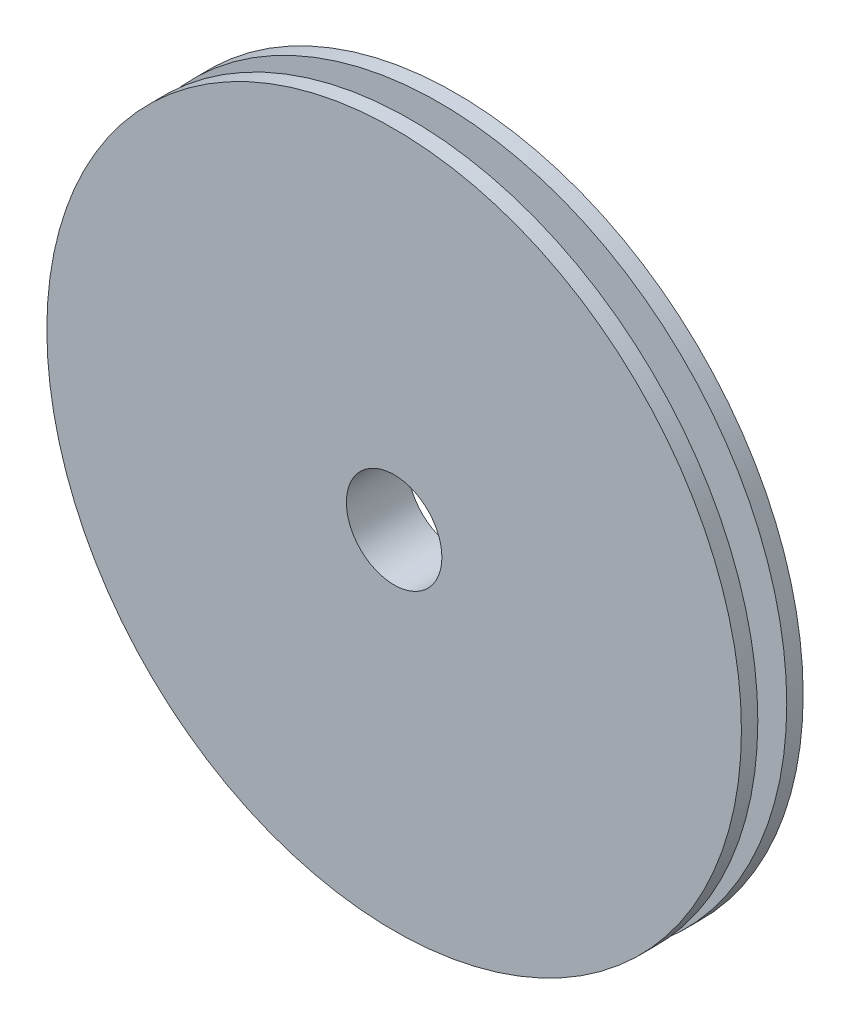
ISO-10303-21;
HEADER;
FILE_DESCRIPTION(('STEP AP214'),'2;1');
FILE_NAME('part.step','',(''),(''),'','','');
FILE_SCHEMA(('AUTOMOTIVE_DESIGN { 1 0 10303 214 1 1 1 1 }'));
ENDSEC;
DATA;
#1=APPLICATION_CONTEXT('core data for automotive mechanical design processes');
#2=APPLICATION_PROTOCOL_DEFINITION('international standard','automotive_design',2000,#1);
#3=PRODUCT_CONTEXT('',#1,'mechanical');
#4=PRODUCT('Part','Part','',(#3));
#5=PRODUCT_RELATED_PRODUCT_CATEGORY('part','',(#4));
#6=PRODUCT_DEFINITION_FORMATION('','',#4);
#7=PRODUCT_DEFINITION_CONTEXT('part definition',#1,'design');
#8=PRODUCT_DEFINITION('design','',#6,#7);
#9=PRODUCT_DEFINITION_SHAPE('','',#8);
#10=(LENGTH_UNIT() NAMED_UNIT(*) SI_UNIT(.MILLI.,.METRE.));
#11=(NAMED_UNIT(*) PLANE_ANGLE_UNIT() SI_UNIT($,.RADIAN.));
#12=(NAMED_UNIT(*) SI_UNIT($,.STERADIAN.) SOLID_ANGLE_UNIT());
#13=UNCERTAINTY_MEASURE_WITH_UNIT(LENGTH_MEASURE(1.E-05),#10,'distance_accuracy_value','');
#14=(GEOMETRIC_REPRESENTATION_CONTEXT(3) GLOBAL_UNCERTAINTY_ASSIGNED_CONTEXT((#13)) GLOBAL_UNIT_ASSIGNED_CONTEXT((#10,
#11,#12)) REPRESENTATION_CONTEXT('',''));
#15=CARTESIAN_POINT('',(0.,0.,0.));
#16=DIRECTION('',(0.,0.,1.));
#17=DIRECTION('',(1.,0.,0.));
#18=AXIS2_PLACEMENT_3D('',#15,#16,#17);
#19=CARTESIAN_POINT('',(0.,0.,33.2));
#20=DIRECTION('',(0.,0.,-1.));
#21=DIRECTION('',(-1.,0.,0.));
#22=AXIS2_PLACEMENT_3D('',#19,#20,#21);
#23=CYLINDRICAL_SURFACE('',#22,18.);
#24=CARTESIAN_POINT('',(0.,0.,30.));
#25=DIRECTION('',(0.,0.,1.));
#26=DIRECTION('',(1.,0.,0.));
#27=AXIS2_PLACEMENT_3D('',#24,#25,#26);
#28=CIRCLE('',#27,18.);
#29=CARTESIAN_POINT('',(18.,0.,30.));
#30=VERTEX_POINT('',#29);
#31=EDGE_CURVE('E44',#30,#30,#28,.T.);
#32=ORIENTED_EDGE('',*,*,#31,.T.);
#33=EDGE_LOOP('',(#32));
#34=FACE_BOUND('',#33,.T.);
#35=CARTESIAN_POINT('',(0.,0.,30.85));
#36=DIRECTION('',(0.,0.,1.));
#37=DIRECTION('',(1.,0.,0.));
#38=AXIS2_PLACEMENT_3D('',#35,#36,#37);
#39=CIRCLE('',#38,18.);
#40=CARTESIAN_POINT('',(18.,0.,30.85));
#41=VERTEX_POINT('',#40);
#42=EDGE_CURVE('E56',#41,#41,#39,.T.);
#43=ORIENTED_EDGE('',*,*,#42,.F.);
#44=EDGE_LOOP('',(#43));
#45=FACE_BOUND('',#44,.T.);
#46=ADVANCED_FACE('F36',(#34,#45),#23,.T.);
#47=CARTESIAN_POINT('',(0.,0.,32.35));
#48=DIRECTION('',(0.,0.,1.));
#49=DIRECTION('',(1.,0.,0.));
#50=AXIS2_PLACEMENT_3D('',#47,#48,#49);
#51=CIRCLE('',#50,18.);
#52=CARTESIAN_POINT('',(18.,0.,32.35));
#53=VERTEX_POINT('',#52);
#54=EDGE_CURVE('E53',#53,#53,#51,.T.);
#55=ORIENTED_EDGE('',*,*,#54,.T.);
#56=EDGE_LOOP('',(#55));
#57=FACE_BOUND('',#56,.T.);
#58=CARTESIAN_POINT('',(0.,0.,33.2));
#59=DIRECTION('',(0.,0.,1.));
#60=DIRECTION('',(1.,0.,0.));
#61=AXIS2_PLACEMENT_3D('',#58,#59,#60);
#62=CIRCLE('',#61,18.);
#63=CARTESIAN_POINT('',(18.,0.,33.2));
#64=VERTEX_POINT('',#63);
#65=EDGE_CURVE('E10',#64,#64,#62,.T.);
#66=ORIENTED_EDGE('',*,*,#65,.F.);
#67=EDGE_LOOP('',(#66));
#68=FACE_BOUND('',#67,.T.);
#69=ADVANCED_FACE('F38',(#57,#68),#23,.T.);
#70=CARTESIAN_POINT('',(0.,0.,33.2));
#71=DIRECTION('',(0.,0.,1.));
#72=DIRECTION('',(1.,0.,0.));
#73=AXIS2_PLACEMENT_3D('',#70,#71,#72);
#74=PLANE('',#73);
#75=CARTESIAN_POINT('',(0.,0.,33.2));
#76=DIRECTION('',(0.,0.,1.));
#77=DIRECTION('',(1.,0.,0.));
#78=AXIS2_PLACEMENT_3D('',#75,#76,#77);
#79=CIRCLE('',#78,2.475);
#80=CARTESIAN_POINT('',(2.475,0.,33.2));
#81=VERTEX_POINT('',#80);
#82=EDGE_CURVE('E49',#81,#81,#79,.F.);
#83=ORIENTED_EDGE('',*,*,#82,.T.);
#84=EDGE_LOOP('',(#83));
#85=FACE_BOUND('',#84,.T.);
#86=ORIENTED_EDGE('',*,*,#65,.T.);
#87=EDGE_LOOP('',(#86));
#88=FACE_BOUND('',#87,.T.);
#89=ADVANCED_FACE('F82',(#85,#88),#74,.T.);
#90=CARTESIAN_POINT('',(0.,0.,30.));
#91=DIRECTION('',(0.,0.,1.));
#92=DIRECTION('',(1.,0.,0.));
#93=AXIS2_PLACEMENT_3D('',#90,#91,#92);
#94=PLANE('',#93);
#95=CARTESIAN_POINT('',(0.,0.,30.));
#96=DIRECTION('',(0.,0.,1.));
#97=DIRECTION('',(1.,0.,0.));
#98=AXIS2_PLACEMENT_3D('',#95,#96,#97);
#99=CIRCLE('',#98,2.475);
#100=CARTESIAN_POINT('',(2.475,0.,30.));
#101=VERTEX_POINT('',#100);
#102=EDGE_CURVE('E40',#101,#101,#99,.F.);
#103=ORIENTED_EDGE('',*,*,#102,.F.);
#104=EDGE_LOOP('',(#103));
#105=FACE_BOUND('',#104,.T.);
#106=ORIENTED_EDGE('',*,*,#31,.F.);
#107=EDGE_LOOP('',(#106));
#108=FACE_BOUND('',#107,.T.);
#109=ADVANCED_FACE('F86',(#105,#108),#94,.F.);
#110=CARTESIAN_POINT('',(0.,0.,50.2));
#111=DIRECTION('',(0.,0.,-1.));
#112=DIRECTION('',(-1.,0.,0.));
#113=AXIS2_PLACEMENT_3D('',#110,#111,#112);
#114=CYLINDRICAL_SURFACE('',#113,2.475);
#115=ORIENTED_EDGE('',*,*,#82,.F.);
#116=EDGE_LOOP('',(#115));
#117=FACE_BOUND('',#116,.T.);
#118=ORIENTED_EDGE('',*,*,#102,.T.);
#119=EDGE_LOOP('',(#118));
#120=FACE_BOUND('',#119,.T.);
#121=ADVANCED_FACE('F73',(#117,#120),#114,.F.);
#122=CARTESIAN_POINT('',(0.,0.,30.85));
#123=DIRECTION('',(0.,0.,1.));
#124=DIRECTION('',(1.,0.,0.));
#125=AXIS2_PLACEMENT_3D('',#122,#123,#124);
#126=PLANE('',#125);
#127=CARTESIAN_POINT('',(0.,0.,30.85));
#128=DIRECTION('',(0.,0.,1.));
#129=DIRECTION('',(1.,0.,0.));
#130=AXIS2_PLACEMENT_3D('',#127,#128,#129);
#131=CIRCLE('',#130,15.5);
#132=CARTESIAN_POINT('',(15.5,0.,30.85));
#133=VERTEX_POINT('',#132);
#134=EDGE_CURVE('E57',#133,#133,#131,.T.);
#135=ORIENTED_EDGE('',*,*,#134,.F.);
#136=EDGE_LOOP('',(#135));
#137=FACE_BOUND('',#136,.T.);
#138=ORIENTED_EDGE('',*,*,#42,.T.);
#139=EDGE_LOOP('',(#138));
#140=FACE_BOUND('',#139,.T.);
#141=ADVANCED_FACE('F69',(#137,#140),#126,.T.);
#142=CARTESIAN_POINT('',(0.,0.,32.35));
#143=DIRECTION('',(0.,0.,1.));
#144=DIRECTION('',(1.,0.,0.));
#145=AXIS2_PLACEMENT_3D('',#142,#143,#144);
#146=PLANE('',#145);
#147=CARTESIAN_POINT('',(0.,0.,32.35));
#148=DIRECTION('',(0.,0.,1.));
#149=DIRECTION('',(1.,0.,0.));
#150=AXIS2_PLACEMENT_3D('',#147,#148,#149);
#151=CIRCLE('',#150,15.5);
#152=CARTESIAN_POINT('',(15.5,0.,32.35));
#153=VERTEX_POINT('',#152);
#154=EDGE_CURVE('E60',#153,#153,#151,.T.);
#155=ORIENTED_EDGE('',*,*,#154,.T.);
#156=EDGE_LOOP('',(#155));
#157=FACE_BOUND('',#156,.T.);
#158=ORIENTED_EDGE('',*,*,#54,.F.);
#159=EDGE_LOOP('',(#158));
#160=FACE_BOUND('',#159,.T.);
#161=ADVANCED_FACE('F72',(#157,#160),#146,.F.);
#162=CARTESIAN_POINT('',(0.,0.,30.85));
#163=DIRECTION('',(0.,0.,1.));
#164=DIRECTION('',(1.,0.,0.));
#165=AXIS2_PLACEMENT_3D('',#162,#163,#164);
#166=CYLINDRICAL_SURFACE('',#165,15.5);
#167=ORIENTED_EDGE('',*,*,#134,.T.);
#168=EDGE_LOOP('',(#167));
#169=FACE_BOUND('',#168,.T.);
#170=ORIENTED_EDGE('',*,*,#154,.F.);
#171=EDGE_LOOP('',(#170));
#172=FACE_BOUND('',#171,.T.);
#173=ADVANCED_FACE('F66',(#169,#172),#166,.T.);
#174=CLOSED_SHELL('',(#46,#69,#89,#109,#121,#141,#161,#173));
#175=MANIFOLD_SOLID_BREP('B2',#174);
#176=ADVANCED_BREP_SHAPE_REPRESENTATION('',(#18,#175),#14);
#177=SHAPE_DEFINITION_REPRESENTATION(#9,#176);
ENDSEC;
END-ISO-10303-21;
